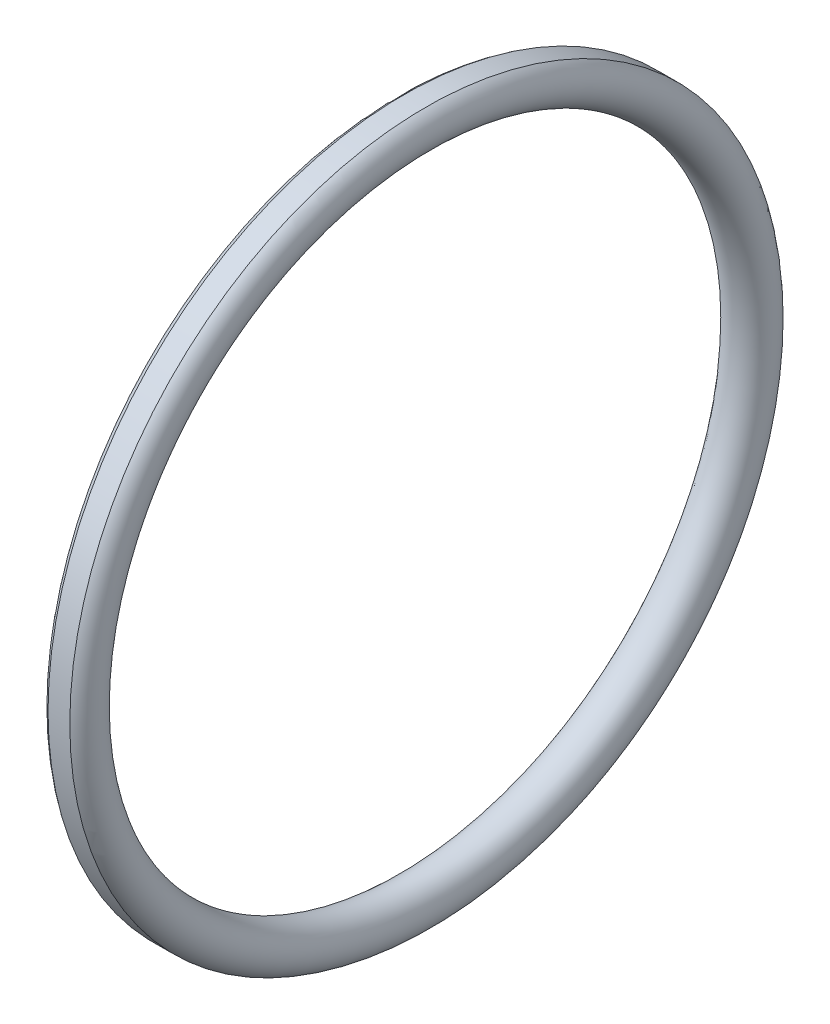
ISO-10303-21;
HEADER;
FILE_DESCRIPTION(('STEP AP214'),'2;1');
FILE_NAME('part.step','',(''),(''),'','','');
FILE_SCHEMA(('AUTOMOTIVE_DESIGN { 1 0 10303 214 1 1 1 1 }'));
ENDSEC;
DATA;
#1=APPLICATION_CONTEXT('core data for automotive mechanical design processes');
#2=APPLICATION_PROTOCOL_DEFINITION('international standard','automotive_design',2000,#1);
#3=PRODUCT_CONTEXT('',#1,'mechanical');
#4=PRODUCT('Part','Part','',(#3));
#5=PRODUCT_RELATED_PRODUCT_CATEGORY('part','',(#4));
#6=PRODUCT_DEFINITION_FORMATION('','',#4);
#7=PRODUCT_DEFINITION_CONTEXT('part definition',#1,'design');
#8=PRODUCT_DEFINITION('design','',#6,#7);
#9=PRODUCT_DEFINITION_SHAPE('','',#8);
#10=(LENGTH_UNIT() NAMED_UNIT(*) SI_UNIT(.MILLI.,.METRE.));
#11=(NAMED_UNIT(*) PLANE_ANGLE_UNIT() SI_UNIT($,.RADIAN.));
#12=(NAMED_UNIT(*) SI_UNIT($,.STERADIAN.) SOLID_ANGLE_UNIT());
#13=UNCERTAINTY_MEASURE_WITH_UNIT(LENGTH_MEASURE(1.E-05),#10,'distance_accuracy_value','');
#14=(GEOMETRIC_REPRESENTATION_CONTEXT(3) GLOBAL_UNCERTAINTY_ASSIGNED_CONTEXT((#13)) GLOBAL_UNIT_ASSIGNED_CONTEXT((#10,
#11,#12)) REPRESENTATION_CONTEXT('',''));
#15=CARTESIAN_POINT('',(0.,0.,0.));
#16=DIRECTION('',(0.,0.,1.));
#17=DIRECTION('',(1.,0.,0.));
#18=AXIS2_PLACEMENT_3D('',#15,#16,#17);
#19=CARTESIAN_POINT('',(0.,0.,0.));
#20=DIRECTION('',(-1.,0.,0.));
#21=DIRECTION('',(0.,0.,1.));
#22=AXIS2_PLACEMENT_3D('',#19,#20,#21);
#23=TOROIDAL_SURFACE('',#22,26.965,1.765);
#24=CARTESIAN_POINT('',(0.871206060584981,0.,0.));
#25=DIRECTION('',(-1.,0.,0.));
#26=DIRECTION('',(0.,0.,1.));
#27=AXIS2_PLACEMENT_3D('',#24,#25,#26);
#28=CIRCLE('',#27,28.5);
#29=CARTESIAN_POINT('',(0.871206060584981,0.,28.5));
#30=VERTEX_POINT('',#29);
#31=EDGE_CURVE('E11',#30,#30,#28,.T.);
#32=ORIENTED_EDGE('',*,*,#31,.F.);
#33=EDGE_LOOP('',(#32));
#34=FACE_BOUND('',#33,.T.);
#35=CARTESIAN_POINT('',(-1.5,0.,0.));
#36=DIRECTION('',(-1.,0.,0.));
#37=DIRECTION('',(0.,0.,1.));
#38=AXIS2_PLACEMENT_3D('',#35,#36,#37);
#39=CIRCLE('',#38,26.0348252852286);
#40=CARTESIAN_POINT('',(-1.5,0.,26.0348252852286));
#41=VERTEX_POINT('',#40);
#42=EDGE_CURVE('E365',#41,#41,#39,.T.);
#43=ORIENTED_EDGE('',*,*,#42,.T.);
#44=EDGE_LOOP('',(#43));
#45=FACE_BOUND('',#44,.T.);
#46=ADVANCED_FACE('F351',(#34,#45),#23,.T.);
#47=CARTESIAN_POINT('',(-14.9506329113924,0.,0.));
#48=DIRECTION('',(-1.,0.,0.));
#49=DIRECTION('',(0.,0.,1.));
#50=AXIS2_PLACEMENT_3D('',#47,#48,#49);
#51=CYLINDRICAL_SURFACE('',#50,28.5);
#52=CARTESIAN_POINT('',(-0.871206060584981,0.,0.));
#53=DIRECTION('',(-1.,0.,0.));
#54=DIRECTION('',(0.,0.,1.));
#55=AXIS2_PLACEMENT_3D('',#52,#53,#54);
#56=CIRCLE('',#55,28.5);
#57=CARTESIAN_POINT('',(-0.871206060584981,0.,28.5));
#58=VERTEX_POINT('',#57);
#59=EDGE_CURVE('E357',#58,#58,#56,.T.);
#60=ORIENTED_EDGE('',*,*,#59,.F.);
#61=EDGE_LOOP('',(#60));
#62=FACE_BOUND('',#61,.T.);
#63=ORIENTED_EDGE('',*,*,#31,.T.);
#64=EDGE_LOOP('',(#63));
#65=FACE_BOUND('',#64,.T.);
#66=ADVANCED_FACE('F380',(#62,#65),#51,.T.);
#67=CARTESIAN_POINT('',(0.,0.,0.));
#68=DIRECTION('',(-1.,0.,0.));
#69=DIRECTION('',(0.,0.,1.));
#70=AXIS2_PLACEMENT_3D('',#67,#68,#69);
#71=TOROIDAL_SURFACE('',#70,26.965,1.765);
#72=CARTESIAN_POINT('',(-1.5,0.,0.));
#73=DIRECTION('',(-1.,0.,0.));
#74=DIRECTION('',(0.,0.,1.));
#75=AXIS2_PLACEMENT_3D('',#72,#73,#74);
#76=CIRCLE('',#75,27.8951747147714);
#77=CARTESIAN_POINT('',(-1.5,0.,27.8951747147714));
#78=VERTEX_POINT('',#77);
#79=EDGE_CURVE('E361',#78,#78,#76,.T.);
#80=ORIENTED_EDGE('',*,*,#79,.F.);
#81=EDGE_LOOP('',(#80));
#82=FACE_BOUND('',#81,.T.);
#83=ORIENTED_EDGE('',*,*,#59,.T.);
#84=EDGE_LOOP('',(#83));
#85=FACE_BOUND('',#84,.T.);
#86=ADVANCED_FACE('F375',(#82,#85),#71,.T.);
#87=CARTESIAN_POINT('',(-1.5,27.8951747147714,0.));
#88=DIRECTION('',(1.,0.,0.));
#89=DIRECTION('',(0.,0.,-1.));
#90=AXIS2_PLACEMENT_3D('',#87,#88,#89);
#91=PLANE('',#90);
#92=ORIENTED_EDGE('',*,*,#42,.F.);
#93=EDGE_LOOP('',(#92));
#94=FACE_BOUND('',#93,.T.);
#95=ORIENTED_EDGE('',*,*,#79,.T.);
#96=EDGE_LOOP('',(#95));
#97=FACE_BOUND('',#96,.T.);
#98=ADVANCED_FACE('F372',(#94,#97),#91,.F.);
#99=CLOSED_SHELL('',(#46,#66,#86,#98));
#100=MANIFOLD_SOLID_BREP('B2',#99);
#101=ADVANCED_BREP_SHAPE_REPRESENTATION('',(#18,#100),#14);
#102=SHAPE_DEFINITION_REPRESENTATION(#9,#101);
ENDSEC;
END-ISO-10303-21;
